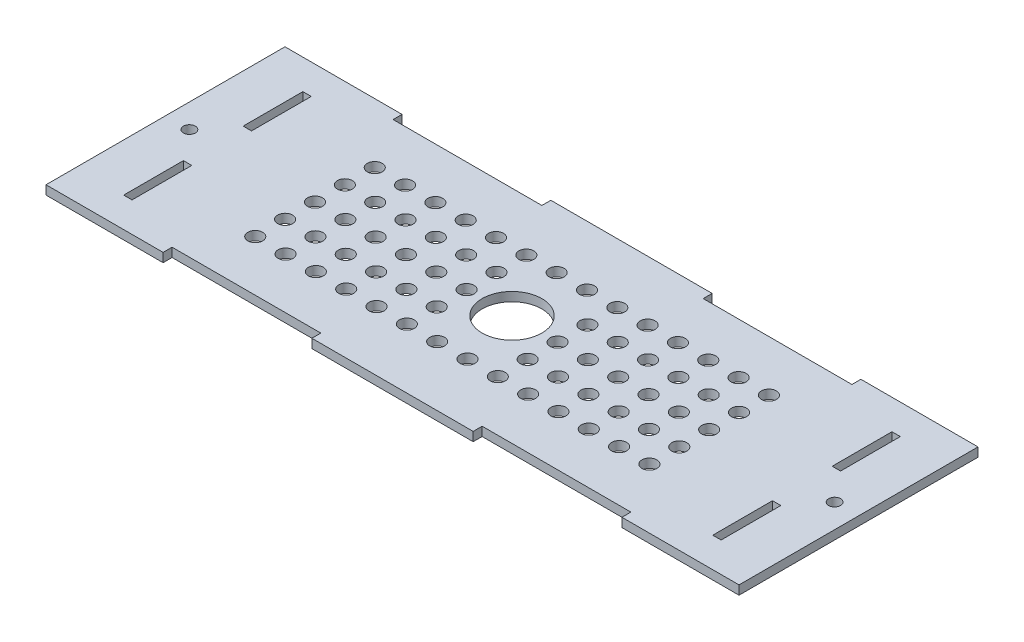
from build123d import *

# Parameters (mm, degrees)
SKETCH1_W           = 232
SKETCH1_H           = 3
EXTRUDE_THIN1_DEPTH = 80
SKETCH2_R           = 2.5
SKETCH2_R_2         = 10
CUT_EXTRUDE1_DEPTH  = 10
SKETCH4_W           = 2.8
SKETCH4_H           = 20
CUT_EXTRUDE3_DEPTH  = 10
SKETCH5_W           = 49.8
SKETCH5_H           = 3
CUT_EXTRUDE4_DEPTH  = 3
SKETCH6_R           = 2
CUT_EXTRUDE5_DEPTH  = 3


with BuildPart() as part:
    # Sketch1 → Extrude-Thin1 (new body)
    with BuildSketch(Plane.XY):
        with Locations((116, -1.5)):
            Rectangle(SKETCH1_W, SKETCH1_H)
    extrude(amount=EXTRUDE_THIN1_DEPTH)

    # Sketch2 → Cut-Extrude1 (cut)
    with BuildSketch(Plane(origin=(0, 0, 0), x_dir=(1, 0, 0), z_dir=(0, 1, 0))):
        with Locations(Location((182, -50, 0), (0, 0, 270))):
            Circle(SKETCH2_R)
        with Locations(Location((141.4, -40, 0), (0, 0, 270))):
            Circle(SKETCH2_R)
        with Locations(Location((141.4, -50, 0), (0, 0, 270))):
            Circle(SKETCH2_R)
        with Locations(Location((141.4, -60, 0), (0, 0, 270))):
            Circle(SKETCH2_R)
        with Locations(Location((131.25, -60, 0), (0, 0, 270))):
            Circle(SKETCH2_R)
        with Locations(Location((131.25, -30, 0), (0, 0, 270))):
            Circle(SKETCH2_R)
        with Locations(Location((131.25, -20, 0), (0, 0, 270))):
            Circle(SKETCH2_R)
        with Locations(Location((100.8, -60, 0), (0, 0, 270))):
            Circle(SKETCH2_R)
        with Locations(Location((80.5, -60, 0), (0, 0, 270))):
            Circle(SKETCH2_R)
        with Locations(Location((50.05, -50, 0), (0, 0, 270))):
            Circle(SKETCH2_R)
        with Locations(Location((80.5, -50, 0), (0, 0, 270))):
            Circle(SKETCH2_R)
        with Locations(Location((70.35, -30, 0), (0, 0, 270))):
            Circle(SKETCH2_R)
        with Locations(Location((50.05, -30, 0), (0, 0, 270))):
            Circle(SKETCH2_R)
        with Locations(Location((116, -40, 0), (0, 0, 270))):
            Circle(SKETCH2_R_2)
        with Locations(Location((182, -20, 0), (0, 0, 270))):
            Circle(SKETCH2_R)
        with Locations(Location((182, -30, 0), (0, 0, 270))):
            Circle(SKETCH2_R)
        with Locations(Location((182, -40, 0), (0, 0, 270))):
            Circle(SKETCH2_R)
        with Locations(Location((182, -60, 0), (0, 0, 270))):
            Circle(SKETCH2_R)
        with Locations(Location((171.85, -20, 0), (0, 0, 270))):
            Circle(SKETCH2_R)
        with Locations(Location((171.85, -30, 0), (0, 0, 270))):
            Circle(SKETCH2_R)
        with Locations(Location((171.85, -40, 0), (0, 0, 270))):
            Circle(SKETCH2_R)
        with Locations(Location((171.85, -50, 0), (0, 0, 270))):
            Circle(SKETCH2_R)
        with Locations(Location((171.85, -60, 0), (0, 0, 270))):
            Circle(SKETCH2_R)
        with Locations(Location((161.7, -20, 0), (0, 0, 270))):
            Circle(SKETCH2_R)
        with Locations(Location((161.7, -30, 0), (0, 0, 270))):
            Circle(SKETCH2_R)
        with Locations(Location((161.7, -40, 0), (0, 0, 270))):
            Circle(SKETCH2_R)
        with Locations(Location((161.7, -50, 0), (0, 0, 270))):
            Circle(SKETCH2_R)
        with Locations(Location((161.7, -60, 0), (0, 0, 270))):
            Circle(SKETCH2_R)
        with Locations(Location((151.55, -60, 0), (0, 0, 270))):
            Circle(SKETCH2_R)
        with Locations(Location((151.55, -50, 0), (0, 0, 270))):
            Circle(SKETCH2_R)
        with Locations(Location((151.55, -40, 0), (0, 0, 270))):
            Circle(SKETCH2_R)
        with Locations(Location((151.55, -30, 0), (0, 0, 270))):
            Circle(SKETCH2_R)
        with Locations(Location((151.55, -20, 0), (0, 0, 270))):
            Circle(SKETCH2_R)
        with Locations(Location((141.4, -20, 0), (0, 0, 270))):
            Circle(SKETCH2_R)
        with Locations(Location((141.4, -30, 0), (0, 0, 270))):
            Circle(SKETCH2_R)
        with Locations(Location((131.25, -50, 0), (0, 0, 270))):
            Circle(SKETCH2_R)
        with Locations(Location((131.25, -40, 0), (0, 0, 270))):
            Circle(SKETCH2_R)
        with Locations(Location((121.1, -20, 0), (0, 0, 270))):
            Circle(SKETCH2_R)
        with Locations(Location((121.1, -60, 0), (0, 0, 270))):
            Circle(SKETCH2_R)
        with Locations(Location((110.95, -60, 0), (0, 0, 270))):
            Circle(SKETCH2_R)
        with Locations(Location((90.65, -60, 0), (0, 0, 270))):
            Circle(SKETCH2_R)
        with Locations(Location((70.35, -60, 0), (0, 0, 270))):
            Circle(SKETCH2_R)
        with Locations(Location((60.2, -60, 0), (0, 0, 270))):
            Circle(SKETCH2_R)
        with Locations(Location((50.05, -60, 0), (0, 0, 270))):
            Circle(SKETCH2_R)
        with Locations(Location((60.2, -50, 0), (0, 0, 270))):
            Circle(SKETCH2_R)
        with Locations(Location((70.35, -50, 0), (0, 0, 270))):
            Circle(SKETCH2_R)
        with Locations(Location((90.65, -50, 0), (0, 0, 270))):
            Circle(SKETCH2_R)
        with Locations(Location((100.8, -50, 0), (0, 0, 270))):
            Circle(SKETCH2_R)
        with Locations(Location((50.05, -40, 0), (0, 0, 270))):
            Circle(SKETCH2_R)
        with Locations(Location((60.2, -40, 0), (0, 0, 270))):
            Circle(SKETCH2_R)
        with Locations(Location((70.35, -40, 0), (0, 0, 270))):
            Circle(SKETCH2_R)
        with Locations(Location((80.5, -40, 0), (0, 0, 270))):
            Circle(SKETCH2_R)
        with Locations(Location((90.65, -40, 0), (0, 0, 270))):
            Circle(SKETCH2_R)
        with Locations(Location((100.8, -40, 0), (0, 0, 270))):
            Circle(SKETCH2_R)
        with Locations(Location((100.8, -30, 0), (0, 0, 270))):
            Circle(SKETCH2_R)
        with Locations(Location((90.65, -30, 0), (0, 0, 270))):
            Circle(SKETCH2_R)
        with Locations(Location((80.5, -30, 0), (0, 0, 270))):
            Circle(SKETCH2_R)
        with Locations(Location((60.2, -30, 0), (0, 0, 270))):
            Circle(SKETCH2_R)
        with Locations(Location((50.05, -20, 0), (0, 0, 270))):
            Circle(SKETCH2_R)
        with Locations(Location((60.2, -20, 0), (0, 0, 270))):
            Circle(SKETCH2_R)
        with Locations(Location((70.35, -20, 0), (0, 0, 270))):
            Circle(SKETCH2_R)
        with Locations(Location((80.5, -20, 0), (0, 0, 270))):
            Circle(SKETCH2_R)
        with Locations(Location((90.65, -20, 0), (0, 0, 270))):
            Circle(SKETCH2_R)
        with Locations(Location((100.8, -20, 0), (0, 0, 270))):
            Circle(SKETCH2_R)
        with Locations(Location((110.95, -20, 0), (0, 0, 270))):
            Circle(SKETCH2_R)
    extrude(amount=-CUT_EXTRUDE1_DEPTH, mode=Mode.SUBTRACT)

    # Sketch4 → Cut-Extrude3 (cut)
    with BuildSketch(Plane(origin=(0, 0, 0), x_dir=(1, 0, 0), z_dir=(0, 1, 0))):
        with Locations((17.4, -20)):
            Rectangle(SKETCH4_W, SKETCH4_H)
        with Locations((17.4, -60)):
            Rectangle(SKETCH4_W, SKETCH4_H)
        with Locations((214.6, -20)):
            Rectangle(SKETCH4_W, SKETCH4_H)
        with Locations((214.6, -60)):
            Rectangle(SKETCH4_W, SKETCH4_H)
    extrude(amount=-CUT_EXTRUDE3_DEPTH, mode=Mode.SUBTRACT)

    # Sketch5 → Cut-Extrude4 (cut)
    with BuildSketch(Plane(origin=(0, 0, 0), x_dir=(1, 0, 0), z_dir=(0, 1, 0))):
        with Locations((64.1, -78.5)):
            Rectangle(SKETCH5_W, SKETCH5_H)
        with Locations((64.1, -1.5)):
            Rectangle(SKETCH5_W, SKETCH5_H)
        with Locations((167.9, -1.5)):
            Rectangle(SKETCH5_W, SKETCH5_H)
        with Locations((167.9, -78.5)):
            Rectangle(SKETCH5_W, SKETCH5_H)
    extrude(amount=-CUT_EXTRUDE4_DEPTH, mode=Mode.SUBTRACT)

    # Sketch6 → Cut-Extrude5 (cut)
    with BuildSketch(Plane(origin=(0, 0, 0), x_dir=(1, 0, 0), z_dir=(0, 1, 0))):
        with Locations(Location((224, -40, 0), (0, 0, 270))):
            Circle(SKETCH6_R)
        with Locations(Location((8, -40, 0), (0, 0, 90))):
            Circle(SKETCH6_R)
    extrude(amount=-CUT_EXTRUDE5_DEPTH, mode=Mode.SUBTRACT)


solid = part.part
